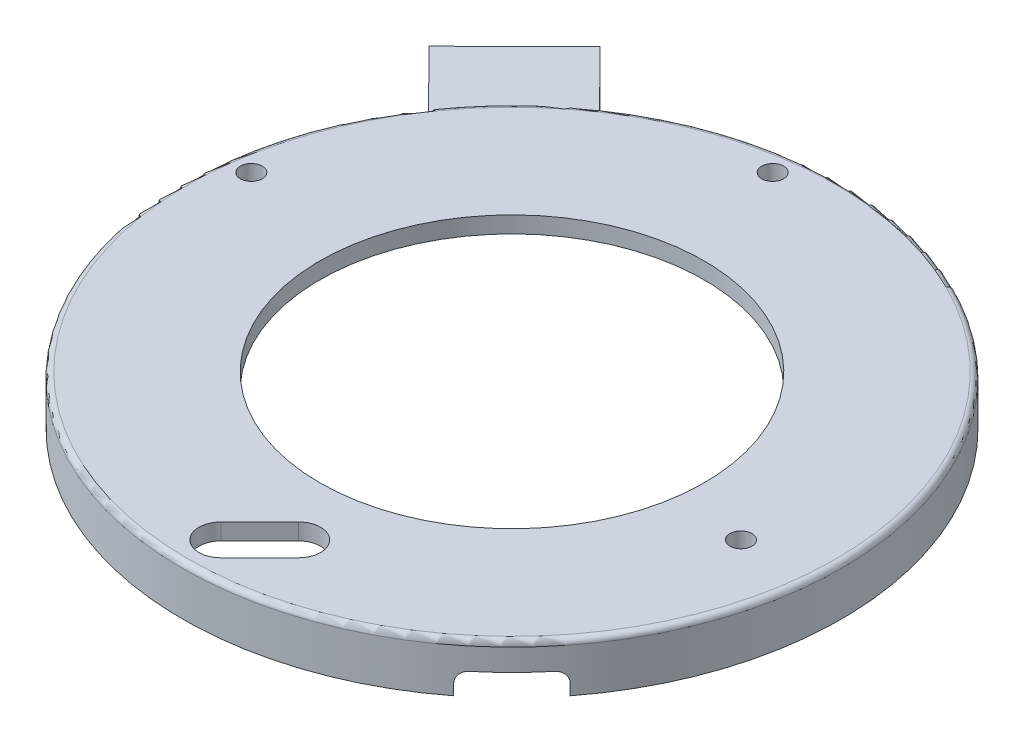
ISO-10303-21;
HEADER;
FILE_DESCRIPTION(('STEP AP214'),'2;1');
FILE_NAME('part.step','',(''),(''),'','','');
FILE_SCHEMA(('AUTOMOTIVE_DESIGN { 1 0 10303 214 1 1 1 1 }'));
ENDSEC;
DATA;
#1=APPLICATION_CONTEXT('core data for automotive mechanical design processes');
#2=APPLICATION_PROTOCOL_DEFINITION('international standard','automotive_design',2000,#1);
#3=PRODUCT_CONTEXT('',#1,'mechanical');
#4=PRODUCT('Part','Part','',(#3));
#5=PRODUCT_RELATED_PRODUCT_CATEGORY('part','',(#4));
#6=PRODUCT_DEFINITION_FORMATION('','',#4);
#7=PRODUCT_DEFINITION_CONTEXT('part definition',#1,'design');
#8=PRODUCT_DEFINITION('design','',#6,#7);
#9=PRODUCT_DEFINITION_SHAPE('','',#8);
#10=(LENGTH_UNIT() NAMED_UNIT(*) SI_UNIT(.MILLI.,.METRE.));
#11=(NAMED_UNIT(*) PLANE_ANGLE_UNIT() SI_UNIT($,.RADIAN.));
#12=(NAMED_UNIT(*) SI_UNIT($,.STERADIAN.) SOLID_ANGLE_UNIT());
#13=UNCERTAINTY_MEASURE_WITH_UNIT(LENGTH_MEASURE(1.E-05),#10,'distance_accuracy_value','');
#14=(GEOMETRIC_REPRESENTATION_CONTEXT(3) GLOBAL_UNCERTAINTY_ASSIGNED_CONTEXT((#13)) GLOBAL_UNIT_ASSIGNED_CONTEXT((#10,
#11,#12)) REPRESENTATION_CONTEXT('',''));
#15=CARTESIAN_POINT('',(0.,0.,0.));
#16=DIRECTION('',(0.,0.,1.));
#17=DIRECTION('',(1.,0.,0.));
#18=AXIS2_PLACEMENT_3D('',#15,#16,#17);
#19=CARTESIAN_POINT('',(0.,-6.,0.));
#20=DIRECTION('',(0.,1.,0.));
#21=DIRECTION('',(0.,0.,1.));
#22=AXIS2_PLACEMENT_3D('',#19,#20,#21);
#23=CYLINDRICAL_SURFACE('',#22,60.);
#24=CARTESIAN_POINT('',(0.,2.,0.));
#25=DIRECTION('',(0.,1.,0.));
#26=DIRECTION('',(0.,0.,1.));
#27=AXIS2_PLACEMENT_3D('',#24,#25,#26);
#28=CIRCLE('',#27,60.);
#29=CARTESIAN_POINT('',(-33.7004398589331,2.,-49.6415184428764));
#30=VERTEX_POINT('',#29);
#31=CARTESIAN_POINT('',(-49.3393981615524,2.,-34.1412329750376));
#32=VERTEX_POINT('',#31);
#33=EDGE_CURVE('E41',#30,#32,#28,.F.);
#34=ORIENTED_EDGE('',*,*,#33,.T.);
#35=DIRECTION('',(0.,1.,0.));
#36=VECTOR('',#35,1.);
#37=CARTESIAN_POINT('',(-49.3393981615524,-6.,-34.1412329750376));
#38=LINE('',#37,#36);
#39=CARTESIAN_POINT('',(-49.3393981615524,-6.,-34.1412329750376));
#40=VERTEX_POINT('',#39);
#41=EDGE_CURVE('E209',#40,#32,#38,.T.);
#42=ORIENTED_EDGE('',*,*,#41,.F.);
#43=CARTESIAN_POINT('',(0.,-6.,0.));
#44=DIRECTION('',(0.,1.,0.));
#45=DIRECTION('',(0.,0.,1.));
#46=AXIS2_PLACEMENT_3D('',#43,#44,#45);
#47=CIRCLE('',#46,60.);
#48=CARTESIAN_POINT('',(36.7903447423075,-6.,47.3969464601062));
#49=VERTEX_POINT('',#48);
#50=EDGE_CURVE('E372',#40,#49,#47,.T.);
#51=ORIENTED_EDGE('',*,*,#50,.T.);
#52=DIRECTION('',(0.,1.,0.));
#53=VECTOR('',#52,1.);
#54=CARTESIAN_POINT('',(36.7903447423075,-6.,47.3969464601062));
#55=LINE('',#54,#53);
#56=CARTESIAN_POINT('',(36.7903447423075,-4.00000000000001,47.3969464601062));
#57=VERTEX_POINT('',#56);
#58=EDGE_CURVE('E385',#49,#57,#55,.T.);
#59=ORIENTED_EDGE('',*,*,#58,.T.);
#60=CARTESIAN_POINT('',(36.7903447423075,-4.00000000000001,47.3969464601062));
#61=CARTESIAN_POINT('',(36.7903445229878,-3.94402619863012,47.3969460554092));
#62=CARTESIAN_POINT('',(36.7922168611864,-3.88807935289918,47.3954933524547));
#63=CARTESIAN_POINT('',(36.7996829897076,-3.77658900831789,47.389696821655));
#64=CARTESIAN_POINT('',(36.8052765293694,-3.72104548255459,47.3853531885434));
#65=CARTESIAN_POINT('',(36.827575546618,-3.55574238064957,47.3680277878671));
#66=CARTESIAN_POINT('',(36.8497996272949,-3.4470948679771,47.3507513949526));
#67=CARTESIAN_POINT('',(36.9082660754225,-3.2360782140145,47.3051926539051));
#68=CARTESIAN_POINT('',(36.9445138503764,-3.13371151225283,47.2769060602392));
#69=CARTESIAN_POINT('',(37.0298831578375,-2.93810429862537,47.2100696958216));
#70=CARTESIAN_POINT('',(37.0790034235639,-2.84486288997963,47.171520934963));
#71=CARTESIAN_POINT('',(37.1888212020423,-2.66974271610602,47.0849919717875));
#72=CARTESIAN_POINT('',(37.2495636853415,-2.58791029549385,47.0369751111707));
#73=CARTESIAN_POINT('',(37.3806741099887,-2.43827680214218,46.9328477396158));
#74=CARTESIAN_POINT('',(37.4510441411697,-2.37047878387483,46.8767354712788));
#75=CARTESIAN_POINT('',(37.5998344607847,-2.25036680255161,46.7574763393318));
#76=CARTESIAN_POINT('',(37.6783081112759,-2.19816561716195,46.6942825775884));
#77=CARTESIAN_POINT('',(37.8405738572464,-2.11136198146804,46.5628805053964));
#78=CARTESIAN_POINT('',(37.9243630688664,-2.07675007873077,46.4946749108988));
#79=CARTESIAN_POINT('',(38.0669809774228,-2.03433416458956,46.3779093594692));
#80=CARTESIAN_POINT('',(38.1250448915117,-2.02146960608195,46.3301911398));
#81=CARTESIAN_POINT('',(38.2416606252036,-2.00430303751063,46.2339827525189));
#82=CARTESIAN_POINT('',(38.3002116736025,-1.99998940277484,46.1854937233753));
#83=CARTESIAN_POINT('',(38.3586937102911,-2.00000000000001,46.1368683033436));
#84=B_SPLINE_CURVE_WITH_KNOTS('',3,(#60,#61,#62,#63,#64,#65,#66,#67,#68,#69,#70,#71,#72,#73,#74,
#75,#76,#77,#78,#79,#80,#81,#82,#83),.UNSPECIFIED.,.F.,.F.,(4,2,2,2,2,2,2,2,2,2,2,4),(0.,
0.167817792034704,0.335624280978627,0.67059928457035,1.00570358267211,1.34077491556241,
1.67716998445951,2.01363819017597,2.35248351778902,2.69114655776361,2.91943823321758,
3.14741934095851),.UNSPECIFIED.);
#85=CARTESIAN_POINT('',(38.3586937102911,-2.00000000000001,46.1368683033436));
#86=VERTEX_POINT('',#85);
#87=EDGE_CURVE('E274',#57,#86,#84,.T.);
#88=ORIENTED_EDGE('',*,*,#87,.T.);
#89=CARTESIAN_POINT('',(0.,-2.00000000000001,0.));
#90=DIRECTION('',(0.,1.,0.));
#91=DIRECTION('',(0.,0.,1.));
#92=AXIS2_PLACEMENT_3D('',#89,#90,#91);
#93=CIRCLE('',#92,60.);
#94=CARTESIAN_POINT('',(46.1368683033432,-2.00000000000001,38.3586937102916));
#95=VERTEX_POINT('',#94);
#96=EDGE_CURVE('E253',#86,#95,#93,.T.);
#97=ORIENTED_EDGE('',*,*,#96,.T.);
#98=CARTESIAN_POINT('',(46.1368683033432,-2.00000000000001,38.3586937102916));
#99=CARTESIAN_POINT('',(46.1731671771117,-2.00000048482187,38.3150350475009));
#100=CARTESIAN_POINT('',(46.2093857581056,-2.00239892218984,38.2713453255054));
#101=CARTESIAN_POINT('',(46.2814409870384,-2.01196421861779,38.1841774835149));
#102=CARTESIAN_POINT('',(46.3172776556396,-2.0191308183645,38.1406993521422));
#103=CARTESIAN_POINT('',(46.423775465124,-2.04771163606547,38.0111235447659));
#104=CARTESIAN_POINT('',(46.4935414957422,-2.07620707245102,37.9257435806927));
#105=CARTESIAN_POINT('',(46.6286210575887,-2.15128547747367,37.7595445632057));
#106=CARTESIAN_POINT('',(46.6939325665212,-2.19787659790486,37.6787275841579));
#107=CARTESIAN_POINT('',(46.8183420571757,-2.30783824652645,37.5240283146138));
#108=CARTESIAN_POINT('',(46.877441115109,-2.37120586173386,37.4501448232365));
#109=CARTESIAN_POINT('',(46.9878220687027,-2.51292344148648,37.3115590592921));
#110=CARTESIAN_POINT('',(47.0391074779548,-2.5912666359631,37.2468526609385));
#111=CARTESIAN_POINT('',(47.1325403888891,-2.76078188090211,37.1285514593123));
#112=CARTESIAN_POINT('',(47.1746862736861,-2.85195619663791,37.0749586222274));
#113=CARTESIAN_POINT('',(47.2485243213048,-3.04406959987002,36.9808129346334));
#114=CARTESIAN_POINT('',(47.2802650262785,-3.14496041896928,36.9401995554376));
#115=CARTESIAN_POINT('',(47.3327055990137,-3.3539833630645,36.8729821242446));
#116=CARTESIAN_POINT('',(47.3534130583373,-3.46211045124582,36.8463684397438));
#117=CARTESIAN_POINT('',(47.3778454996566,-3.64247319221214,36.8149425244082));
#118=CARTESIAN_POINT('',(47.385004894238,-3.71352479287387,36.8057252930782));
#119=CARTESIAN_POINT('',(47.3945541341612,-3.85637372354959,36.7934268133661));
#120=CARTESIAN_POINT('',(47.3969506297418,-3.92816987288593,36.7903370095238));
#121=CARTESIAN_POINT('',(47.3969464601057,-4.00000000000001,36.790344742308));
#122=B_SPLINE_CURVE_WITH_KNOTS('',3,(#98,#99,#100,#101,#102,#103,#104,#105,#106,#107,#108,#109,
#110,#111,#112,#113,#114,#115,#116,#117,#118,#119,#120,#121),.UNSPECIFIED.,.F.,.F.,(4,2,2,2,2,2,
2,2,2,2,2,4),(0.,0.170227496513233,0.340445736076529,0.680339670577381,1.02038689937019,
1.36037512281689,1.70021000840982,2.04010496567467,2.37839090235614,2.71644377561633,
2.93206295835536,3.14738086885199),.UNSPECIFIED.);
#123=CARTESIAN_POINT('',(47.3969464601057,-4.00000000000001,36.790344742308));
#124=VERTEX_POINT('',#123);
#125=EDGE_CURVE('E256',#95,#124,#122,.T.);
#126=ORIENTED_EDGE('',*,*,#125,.T.);
#127=DIRECTION('',(0.,1.,0.));
#128=VECTOR('',#127,1.);
#129=CARTESIAN_POINT('',(47.3969464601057,-6.,36.790344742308));
#130=LINE('',#129,#128);
#131=CARTESIAN_POINT('',(47.3969464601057,-6.,36.790344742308));
#132=VERTEX_POINT('',#131);
#133=EDGE_CURVE('E264',#124,#132,#130,.F.);
#134=ORIENTED_EDGE('',*,*,#133,.T.);
#135=CARTESIAN_POINT('',(-33.7004398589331,-6.,-49.6415184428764));
#136=VERTEX_POINT('',#135);
#137=EDGE_CURVE('E346',#132,#136,#47,.T.);
#138=ORIENTED_EDGE('',*,*,#137,.T.);
#139=DIRECTION('',(0.,1.,0.));
#140=VECTOR('',#139,1.);
#141=CARTESIAN_POINT('',(-33.7004398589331,-6.,-49.6415184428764));
#142=LINE('',#141,#140);
#143=EDGE_CURVE('E202',#136,#30,#142,.T.);
#144=ORIENTED_EDGE('',*,*,#143,.T.);
#145=EDGE_LOOP('',(#34,#42,#51,#59,#88,#97,#126,#134,#138,#144));
#146=FACE_BOUND('',#145,.T.);
#147=ADVANCED_FACE('F33',(#146),#23,.T.);
#148=CARTESIAN_POINT('',(0.,0.,0.));
#149=DIRECTION('',(0.,1.,0.));
#150=DIRECTION('',(0.,0.,1.));
#151=AXIS2_PLACEMENT_3D('',#148,#149,#150);
#152=PLANE('',#151);
#153=CARTESIAN_POINT('',(0.,0.,0.));
#154=DIRECTION('',(0.,1.,0.));
#155=DIRECTION('',(0.,0.,1.));
#156=AXIS2_PLACEMENT_3D('',#153,#154,#155);
#157=CIRCLE('',#156,35.);
#158=CARTESIAN_POINT('',(0.,0.,35.));
#159=VERTEX_POINT('',#158);
#160=EDGE_CURVE('E166',#159,#159,#157,.T.);
#161=ORIENTED_EDGE('',*,*,#160,.T.);
#162=EDGE_LOOP('',(#161));
#163=FACE_BOUND('',#162,.T.);
#164=CARTESIAN_POINT('',(47.3431457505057,0.,5.65685424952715));
#165=DIRECTION('',(0.,1.,0.));
#166=DIRECTION('',(0.,0.,1.));
#167=AXIS2_PLACEMENT_3D('',#164,#165,#166);
#168=CIRCLE('',#167,2.);
#169=CARTESIAN_POINT('',(47.3431457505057,0.,7.65685424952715));
#170=VERTEX_POINT('',#169);
#171=EDGE_CURVE('E183',#170,#170,#168,.T.);
#172=ORIENTED_EDGE('',*,*,#171,.T.);
#173=EDGE_LOOP('',(#172));
#174=FACE_BOUND('',#173,.T.);
#175=CARTESIAN_POINT('',(-55.1702534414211,0.,-7.69999999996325));
#176=DIRECTION('',(0.,1.,0.));
#177=DIRECTION('',(0.,0.,1.));
#178=AXIS2_PLACEMENT_3D('',#175,#176,#177);
#179=CIRCLE('',#178,2.);
#180=CARTESIAN_POINT('',(-55.1702534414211,0.,-5.69999999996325));
#181=VERTEX_POINT('',#180);
#182=EDGE_CURVE('E180',#181,#181,#179,.T.);
#183=ORIENTED_EDGE('',*,*,#182,.T.);
#184=EDGE_LOOP('',(#183));
#185=FACE_BOUND('',#184,.T.);
#186=DIRECTION('',(-0.707106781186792,0.,0.707106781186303));
#187=VECTOR('',#186,1.);
#188=CARTESIAN_POINT('',(23.6715728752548,0.,23.6715728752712));
#189=LINE('',#188,#187);
#190=CARTESIAN_POINT('',(4.24264068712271,0.,43.1005050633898));
#191=VERTEX_POINT('',#190);
#192=CARTESIAN_POINT('',(-2.82842712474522,0.,50.1715728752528));
#193=VERTEX_POINT('',#192);
#194=EDGE_CURVE('E174',#191,#193,#189,.T.);
#195=ORIENTED_EDGE('',*,*,#194,.T.);
#196=CARTESIAN_POINT('',(0.,0.,53.));
#197=DIRECTION('',(0.,1.,0.));
#198=DIRECTION('',(0.,0.,1.));
#199=AXIS2_PLACEMENT_3D('',#196,#197,#198);
#200=CIRCLE('',#199,4.);
#201=CARTESIAN_POINT('',(2.82842712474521,0.,55.8284271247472));
#202=VERTEX_POINT('',#201);
#203=EDGE_CURVE('E177',#193,#202,#200,.T.);
#204=ORIENTED_EDGE('',*,*,#203,.T.);
#205=DIRECTION('',(0.707106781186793,0.,-0.707106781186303));
#206=VECTOR('',#205,1.);
#207=CARTESIAN_POINT('',(29.3284271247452,0.,29.3284271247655));
#208=LINE('',#207,#206);
#209=CARTESIAN_POINT('',(9.89949493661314,0.,48.7573593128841));
#210=VERTEX_POINT('',#209);
#211=EDGE_CURVE('E170',#202,#210,#208,.T.);
#212=ORIENTED_EDGE('',*,*,#211,.T.);
#213=CARTESIAN_POINT('',(7.07106781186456,0.,45.9289321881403));
#214=DIRECTION('',(0.,1.,0.));
#215=DIRECTION('',(0.,0.,1.));
#216=AXIS2_PLACEMENT_3D('',#213,#214,#215);
#217=CIRCLE('',#216,4.);
#218=EDGE_CURVE('E140',#210,#191,#217,.T.);
#219=ORIENTED_EDGE('',*,*,#218,.T.);
#220=EDGE_LOOP('',(#195,#204,#212,#219));
#221=FACE_BOUND('',#220,.T.);
#222=CARTESIAN_POINT('',(-7.7,0.,-55.1702534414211));
#223=DIRECTION('',(0.,1.,0.));
#224=DIRECTION('',(0.,0.,1.));
#225=AXIS2_PLACEMENT_3D('',#222,#223,#224);
#226=CIRCLE('',#225,2.);
#227=CARTESIAN_POINT('',(-7.7,0.,-53.1702534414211));
#228=VERTEX_POINT('',#227);
#229=EDGE_CURVE('E167',#228,#228,#226,.T.);
#230=ORIENTED_EDGE('',*,*,#229,.T.);
#231=EDGE_LOOP('',(#230));
#232=FACE_BOUND('',#231,.T.);
#233=CARTESIAN_POINT('',(28.2842712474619,0.,28.2842712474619));
#234=DIRECTION('',(0.,1.,0.));
#235=DIRECTION('',(0.,0.,1.));
#236=AXIS2_PLACEMENT_3D('',#233,#234,#235);
#237=CIRCLE('',#236,2.5);
#238=CARTESIAN_POINT('',(28.2842712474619,0.,30.7842712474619));
#239=VERTEX_POINT('',#238);
#240=EDGE_CURVE('E220',#239,#239,#237,.F.);
#241=ORIENTED_EDGE('',*,*,#240,.F.);
#242=EDGE_LOOP('',(#241));
#243=FACE_BOUND('',#242,.T.);
#244=CARTESIAN_POINT('',(0.,0.,0.));
#245=DIRECTION('',(0.,1.,0.));
#246=DIRECTION('',(0.,0.,1.));
#247=AXIS2_PLACEMENT_3D('',#244,#245,#246);
#248=CIRCLE('',#247,58.);
#249=CARTESIAN_POINT('',(0.,0.,58.));
#250=VERTEX_POINT('',#249);
#251=EDGE_CURVE('E340',#250,#250,#248,.T.);
#252=ORIENTED_EDGE('',*,*,#251,.F.);
#253=EDGE_LOOP('',(#252));
#254=FACE_BOUND('',#253,.T.);
#255=ADVANCED_FACE('F309',(#163,#174,#185,#221,#232,#243,#254),#152,.F.);
#256=CARTESIAN_POINT('',(28.2842712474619,-3.,28.2842712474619));
#257=DIRECTION('',(0.,1.,0.));
#258=DIRECTION('',(0.,0.,1.));
#259=AXIS2_PLACEMENT_3D('',#256,#257,#258);
#260=CYLINDRICAL_SURFACE('',#259,2.5);
#261=CARTESIAN_POINT('',(28.2842712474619,-3.,28.2842712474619));
#262=DIRECTION('',(0.,-1.,0.));
#263=DIRECTION('',(0.,0.,-1.));
#264=AXIS2_PLACEMENT_3D('',#261,#262,#263);
#265=CIRCLE('',#264,2.5);
#266=CARTESIAN_POINT('',(28.2842712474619,-3.,25.7842712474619));
#267=VERTEX_POINT('',#266);
#268=EDGE_CURVE('E342',#267,#267,#265,.T.);
#269=ORIENTED_EDGE('',*,*,#268,.F.);
#270=EDGE_LOOP('',(#269));
#271=FACE_BOUND('',#270,.T.);
#272=ORIENTED_EDGE('',*,*,#240,.T.);
#273=EDGE_LOOP('',(#272));
#274=FACE_BOUND('',#273,.T.);
#275=ADVANCED_FACE('F313',(#271,#274),#260,.T.);
#276=CARTESIAN_POINT('',(28.2842712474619,-3.,28.2842712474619));
#277=DIRECTION('',(0.,-1.,0.));
#278=DIRECTION('',(0.,0.,-1.));
#279=AXIS2_PLACEMENT_3D('',#276,#277,#278);
#280=PLANE('',#279);
#281=CARTESIAN_POINT('',(28.2842712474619,-3.,28.2842712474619));
#282=DIRECTION('',(0.,-1.,0.));
#283=DIRECTION('',(0.,0.,-1.));
#284=AXIS2_PLACEMENT_3D('',#281,#282,#283);
#285=CIRCLE('',#284,2.);
#286=CARTESIAN_POINT('',(28.2842712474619,-3.,26.2842712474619));
#287=VERTEX_POINT('',#286);
#288=EDGE_CURVE('E216',#287,#287,#285,.T.);
#289=ORIENTED_EDGE('',*,*,#288,.F.);
#290=EDGE_LOOP('',(#289));
#291=FACE_BOUND('',#290,.T.);
#292=ORIENTED_EDGE('',*,*,#268,.T.);
#293=EDGE_LOOP('',(#292));
#294=FACE_BOUND('',#293,.T.);
#295=ADVANCED_FACE('F302',(#291,#294),#280,.T.);
#296=CARTESIAN_POINT('',(0.,-6.,0.));
#297=DIRECTION('',(0.,1.,0.));
#298=DIRECTION('',(0.,0.,1.));
#299=AXIS2_PLACEMENT_3D('',#296,#297,#298);
#300=CYLINDRICAL_SURFACE('',#299,58.);
#301=CARTESIAN_POINT('',(0.,-6.,0.));
#302=DIRECTION('',(0.,1.,0.));
#303=DIRECTION('',(0.,0.,1.));
#304=AXIS2_PLACEMENT_3D('',#301,#302,#303);
#305=CIRCLE('',#304,58.);
#306=CARTESIAN_POINT('',(45.9711628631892,-6.,35.3645611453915));
#307=VERTEX_POINT('',#306);
#308=CARTESIAN_POINT('',(35.364561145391,-6.,45.9711628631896));
#309=VERTEX_POINT('',#308);
#310=EDGE_CURVE('E283',#307,#309,#305,.T.);
#311=ORIENTED_EDGE('',*,*,#310,.F.);
#312=DIRECTION('',(0.,1.,0.));
#313=VECTOR('',#312,1.);
#314=CARTESIAN_POINT('',(45.9711628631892,-6.,35.3645611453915));
#315=LINE('',#314,#313);
#316=CARTESIAN_POINT('',(45.9711628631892,-4.00000000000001,35.3645611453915));
#317=VERTEX_POINT('',#316);
#318=EDGE_CURVE('E248',#307,#317,#315,.T.);
#319=ORIENTED_EDGE('',*,*,#318,.T.);
#320=CARTESIAN_POINT('',(45.9711628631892,-4.00000000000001,35.3645611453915));
#321=CARTESIAN_POINT('',(45.9711624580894,-3.9440470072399,35.3645609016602));
#322=CARTESIAN_POINT('',(45.969718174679,-3.88812097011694,35.3664392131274));
#323=CARTESIAN_POINT('',(45.9639552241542,-3.77667230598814,35.3739290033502));
#324=CARTESIAN_POINT('',(45.9596367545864,-3.7211496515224,35.3795402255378));
#325=CARTESIAN_POINT('',(45.9424118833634,-3.55591098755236,35.4019090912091));
#326=CARTESIAN_POINT('',(45.9252358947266,-3.44730695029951,35.424202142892));
#327=CARTESIAN_POINT('',(45.8799414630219,-3.23637599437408,35.482845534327));
#328=CARTESIAN_POINT('',(45.8518188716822,-3.13405147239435,35.519201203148));
#329=CARTESIAN_POINT('',(45.7853678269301,-2.93852203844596,35.6048173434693));
#330=CARTESIAN_POINT('',(45.7470403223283,-2.84531627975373,35.6540766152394));
#331=CARTESIAN_POINT('',(45.6609912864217,-2.67023126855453,35.7642106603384));
#332=CARTESIAN_POINT('',(45.6132307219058,-2.58840157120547,35.8251336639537));
#333=CARTESIAN_POINT('',(45.5096486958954,-2.43876286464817,35.956624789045));
#334=CARTESIAN_POINT('',(45.4538254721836,-2.37095692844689,36.0271950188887));
#335=CARTESIAN_POINT('',(45.3351372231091,-2.25078439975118,36.1764354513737));
#336=CARTESIAN_POINT('',(45.2722222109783,-2.19853824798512,36.2551627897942));
#337=CARTESIAN_POINT('',(45.1413786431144,-2.11164325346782,36.4179462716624));
#338=CARTESIAN_POINT('',(45.0734527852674,-2.07698501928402,36.5019995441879));
#339=CARTESIAN_POINT('',(44.9570626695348,-2.03446044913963,36.6451641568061));
#340=CARTESIAN_POINT('',(44.9094407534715,-2.02154878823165,36.7035122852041));
#341=CARTESIAN_POINT('',(44.8134147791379,-2.00431903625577,36.8206959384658));
#342=CARTESIAN_POINT('',(44.7650118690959,-1.99998931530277,36.8795306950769));
#343=CARTESIAN_POINT('',(44.7164678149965,-2.00000000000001,36.938293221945));
#344=B_SPLINE_CURVE_WITH_KNOTS('',3,(#320,#321,#322,#323,#324,#325,#326,#327,#328,#329,#330,
#331,#332,#333,#334,#335,#336,#337,#338,#339,#340,#341,#342,#343),.UNSPECIFIED.,.F.,.F.,(4,2,2,
2,2,2,2,2,2,2,2,4),(0.,0.167755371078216,0.335499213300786,0.670343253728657,1.0053143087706,
1.34025423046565,1.67661029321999,2.01303998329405,2.35200989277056,2.69079861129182,
2.91958134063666,3.14805382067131),.UNSPECIFIED.);
#345=CARTESIAN_POINT('',(44.7164678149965,-2.00000000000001,36.9382932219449));
#346=VERTEX_POINT('',#345);
#347=EDGE_CURVE('E239',#317,#346,#344,.T.);
#348=ORIENTED_EDGE('',*,*,#347,.T.);
#349=CARTESIAN_POINT('',(0.,-2.00000000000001,0.));
#350=DIRECTION('',(0.,-1.,0.));
#351=DIRECTION('',(0.,0.,-1.));
#352=AXIS2_PLACEMENT_3D('',#349,#350,#351);
#353=CIRCLE('',#352,58.);
#354=CARTESIAN_POINT('',(36.9382932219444,-2.00000000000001,44.7164678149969));
#355=VERTEX_POINT('',#354);
#356=EDGE_CURVE('E247',#346,#355,#353,.T.);
#357=ORIENTED_EDGE('',*,*,#356,.T.);
#358=CARTESIAN_POINT('',(36.9382932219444,-2.00000000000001,44.7164678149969));
#359=CARTESIAN_POINT('',(36.8944917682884,-2.00000049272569,44.7526508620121));
#360=CARTESIAN_POINT('',(36.8506576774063,-2.00240053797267,44.7887512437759));
#361=CARTESIAN_POINT('',(36.7631989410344,-2.01197202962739,44.8605661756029));
#362=CARTESIAN_POINT('',(36.7195742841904,-2.01914321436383,44.8962807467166));
#363=CARTESIAN_POINT('',(36.5895572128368,-2.04774198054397,45.0024083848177));
#364=CARTESIAN_POINT('',(36.5038807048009,-2.07625497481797,45.0719218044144));
#365=CARTESIAN_POINT('',(36.337094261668,-2.1513787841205,45.2064940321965));
#366=CARTESIAN_POINT('',(36.2559863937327,-2.19799771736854,45.2715508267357));
#367=CARTESIAN_POINT('',(36.1007217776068,-2.30802586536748,45.3954596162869));
#368=CARTESIAN_POINT('',(36.0265638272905,-2.37143216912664,45.4543126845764));
#369=CARTESIAN_POINT('',(35.8874603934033,-2.51323699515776,45.5642190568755));
#370=CARTESIAN_POINT('',(35.8225104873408,-2.59162827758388,45.615276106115));
#371=CARTESIAN_POINT('',(35.7037642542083,-2.76125172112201,45.7082806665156));
#372=CARTESIAN_POINT('',(35.6499698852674,-2.85248613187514,45.7502265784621));
#373=CARTESIAN_POINT('',(35.5554944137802,-3.04469642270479,45.8236881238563));
#374=CARTESIAN_POINT('',(35.5147480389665,-3.14562042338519,45.8552556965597));
#375=CARTESIAN_POINT('',(35.4473221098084,-3.35471182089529,45.9073979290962));
#376=CARTESIAN_POINT('',(35.4206327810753,-3.4628741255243,45.9279802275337));
#377=CARTESIAN_POINT('',(35.3891621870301,-3.64314301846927,45.9522299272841));
#378=CARTESIAN_POINT('',(35.3799437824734,-3.71406278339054,45.9593263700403));
#379=CARTESIAN_POINT('',(35.3676436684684,-3.85664447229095,45.9687915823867));
#380=CARTESIAN_POINT('',(35.3645534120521,-3.9283052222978,45.9711669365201));
#381=CARTESIAN_POINT('',(35.364561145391,-4.00000000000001,45.9711628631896));
#382=B_SPLINE_CURVE_WITH_KNOTS('',3,(#358,#359,#360,#361,#362,#363,#364,#365,#366,#367,#368,
#369,#370,#371,#372,#373,#374,#375,#376,#377,#378,#379,#380,#381),.UNSPECIFIED.,.F.,.F.,(4,2,2,
2,2,2,2,2,2,2,2,4),(0.,0.17033550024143,0.340661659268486,0.68077240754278,1.02103582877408,
1.36124028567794,1.70128078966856,2.04138093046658,2.37975214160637,2.71788775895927,
2.9331003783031,3.14801262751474),.UNSPECIFIED.);
#383=CARTESIAN_POINT('',(35.364561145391,-4.00000000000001,45.9711628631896));
#384=VERTEX_POINT('',#383);
#385=EDGE_CURVE('E215',#355,#384,#382,.T.);
#386=ORIENTED_EDGE('',*,*,#385,.T.);
#387=DIRECTION('',(0.,1.,0.));
#388=VECTOR('',#387,1.);
#389=CARTESIAN_POINT('',(35.364561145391,-6.,45.9711628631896));
#390=LINE('',#389,#388);
#391=EDGE_CURVE('E229',#384,#309,#390,.F.);
#392=ORIENTED_EDGE('',*,*,#391,.T.);
#393=EDGE_LOOP('',(#311,#319,#348,#357,#386,#392));
#394=FACE_BOUND('',#393,.T.);
#395=ORIENTED_EDGE('',*,*,#251,.T.);
#396=EDGE_LOOP('',(#395));
#397=FACE_BOUND('',#396,.T.);
#398=ADVANCED_FACE('F298',(#394,#397),#300,.F.);
#399=CARTESIAN_POINT('',(0.,-6.,0.));
#400=DIRECTION('',(0.,1.,0.));
#401=DIRECTION('',(0.,0.,1.));
#402=AXIS2_PLACEMENT_3D('',#399,#400,#401);
#403=PLANE('',#402);
#404=ORIENTED_EDGE('',*,*,#50,.F.);
#405=DIRECTION('',(-0.704092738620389,0.,-0.710108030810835));
#406=VECTOR('',#405,1.);
#407=CARTESIAN_POINT('',(-49.3393981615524,-6.,-34.1412329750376));
#408=LINE('',#407,#406);
#409=CARTESIAN_POINT('',(-59.9007892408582,-6.,-44.7928534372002));
#410=VERTEX_POINT('',#409);
#411=EDGE_CURVE('E195',#40,#410,#408,.T.);
#412=ORIENTED_EDGE('',*,*,#411,.T.);
#413=DIRECTION('',(0.710248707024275,0.,-0.703950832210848));
#414=VECTOR('',#413,1.);
#415=CARTESIAN_POINT('',(-59.9007892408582,-6.,-44.7928534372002));
#416=LINE('',#415,#414);
#417=CARTESIAN_POINT('',(-44.2597021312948,-6.,-60.2952488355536));
#418=VERTEX_POINT('',#417);
#419=EDGE_CURVE('E197',#410,#418,#416,.T.);
#420=ORIENTED_EDGE('',*,*,#419,.T.);
#421=DIRECTION('',(0.703950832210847,0.,0.710248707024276));
#422=VECTOR('',#421,1.);
#423=CARTESIAN_POINT('',(-44.2597021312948,-6.,-60.2952488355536));
#424=LINE('',#423,#422);
#425=EDGE_CURVE('E199',#418,#136,#424,.T.);
#426=ORIENTED_EDGE('',*,*,#425,.T.);
#427=ORIENTED_EDGE('',*,*,#137,.F.);
#428=DIRECTION('',(0.707106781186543,0.,0.707106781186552));
#429=VECTOR('',#428,1.);
#430=CARTESIAN_POINT('',(65.3043008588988,-6.,54.6976991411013));
#431=LINE('',#430,#429);
#432=EDGE_CURVE('E249',#307,#132,#431,.T.);
#433=ORIENTED_EDGE('',*,*,#432,.F.);
#434=ORIENTED_EDGE('',*,*,#310,.T.);
#435=DIRECTION('',(-0.707106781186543,0.,-0.707106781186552));
#436=VECTOR('',#435,1.);
#437=CARTESIAN_POINT('',(54.6976991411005,-6.,65.3043008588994));
#438=LINE('',#437,#436);
#439=EDGE_CURVE('E251',#49,#309,#438,.T.);
#440=ORIENTED_EDGE('',*,*,#439,.F.);
#441=EDGE_LOOP('',(#404,#412,#420,#426,#427,#433,#434,#440));
#442=FACE_BOUND('',#441,.T.);
#443=ADVANCED_FACE('F301',(#442),#403,.F.);
#444=CARTESIAN_POINT('',(56.1119127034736,-2.00000000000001,63.8900872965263));
#445=DIRECTION('',(0.,1.,0.));
#446=DIRECTION('',(0.,0.,1.));
#447=AXIS2_PLACEMENT_3D('',#444,#445,#446);
#448=PLANE('',#447);
#449=DIRECTION('',(-0.707106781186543,0.,-0.707106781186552));
#450=VECTOR('',#449,1.);
#451=CARTESIAN_POINT('',(56.1119127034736,-2.00000000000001,63.8900872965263));
#452=LINE('',#451,#450);
#453=EDGE_CURVE('E384',#86,#355,#452,.T.);
#454=ORIENTED_EDGE('',*,*,#453,.T.);
#455=ORIENTED_EDGE('',*,*,#356,.F.);
#456=DIRECTION('',(-0.707106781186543,0.,-0.707106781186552));
#457=VECTOR('',#456,1.);
#458=CARTESIAN_POINT('',(63.8900872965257,-2.00000000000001,56.1119127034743));
#459=LINE('',#458,#457);
#460=EDGE_CURVE('E386',#95,#346,#459,.T.);
#461=ORIENTED_EDGE('',*,*,#460,.F.);
#462=ORIENTED_EDGE('',*,*,#96,.F.);
#463=EDGE_LOOP('',(#454,#455,#461,#462));
#464=FACE_BOUND('',#463,.T.);
#465=ADVANCED_FACE('F293',(#464),#448,.F.);
#466=CARTESIAN_POINT('',(54.6976991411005,-10.,65.3043008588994));
#467=DIRECTION('',(-0.707106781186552,0.,0.707106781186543));
#468=DIRECTION('',(0.707106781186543,0.,0.707106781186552));
#469=AXIS2_PLACEMENT_3D('',#466,#467,#468);
#470=PLANE('',#469);
#471=ORIENTED_EDGE('',*,*,#439,.T.);
#472=ORIENTED_EDGE('',*,*,#391,.F.);
#473=DIRECTION('',(-0.707106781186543,0.,-0.707106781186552));
#474=VECTOR('',#473,1.);
#475=CARTESIAN_POINT('',(54.6976991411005,-4.00000000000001,65.3043008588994));
#476=LINE('',#475,#474);
#477=EDGE_CURVE('E285',#57,#384,#476,.T.);
#478=ORIENTED_EDGE('',*,*,#477,.F.);
#479=ORIENTED_EDGE('',*,*,#58,.F.);
#480=EDGE_LOOP('',(#471,#472,#478,#479));
#481=FACE_BOUND('',#480,.T.);
#482=ADVANCED_FACE('F294',(#481),#470,.F.);
#483=CARTESIAN_POINT('',(65.3043008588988,-10.,54.6976991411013));
#484=DIRECTION('',(0.707106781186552,0.,-0.707106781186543));
#485=DIRECTION('',(-0.707106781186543,0.,-0.707106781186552));
#486=AXIS2_PLACEMENT_3D('',#483,#484,#485);
#487=PLANE('',#486);
#488=DIRECTION('',(-0.707106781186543,0.,-0.707106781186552));
#489=VECTOR('',#488,1.);
#490=CARTESIAN_POINT('',(65.3043008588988,-4.00000000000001,54.6976991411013));
#491=LINE('',#490,#489);
#492=EDGE_CURVE('E284',#124,#317,#491,.T.);
#493=ORIENTED_EDGE('',*,*,#492,.T.);
#494=ORIENTED_EDGE('',*,*,#318,.F.);
#495=ORIENTED_EDGE('',*,*,#432,.T.);
#496=ORIENTED_EDGE('',*,*,#133,.F.);
#497=EDGE_LOOP('',(#493,#494,#495,#496));
#498=FACE_BOUND('',#497,.T.);
#499=ADVANCED_FACE('F271',(#498),#487,.F.);
#500=CARTESIAN_POINT('',(63.8900872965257,-4.00000000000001,56.1119127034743));
#501=DIRECTION('',(-0.707106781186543,0.,-0.707106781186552));
#502=DIRECTION('',(-0.707106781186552,0.,0.707106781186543));
#503=AXIS2_PLACEMENT_3D('',#500,#501,#502);
#504=CYLINDRICAL_SURFACE('',#503,2.);
#505=ORIENTED_EDGE('',*,*,#460,.T.);
#506=ORIENTED_EDGE('',*,*,#347,.F.);
#507=ORIENTED_EDGE('',*,*,#492,.F.);
#508=ORIENTED_EDGE('',*,*,#125,.F.);
#509=EDGE_LOOP('',(#505,#506,#507,#508));
#510=FACE_BOUND('',#509,.T.);
#511=ADVANCED_FACE('F266',(#510),#504,.F.);
#512=CARTESIAN_POINT('',(56.1119127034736,-4.00000000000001,63.8900872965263));
#513=DIRECTION('',(-0.707106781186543,0.,-0.707106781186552));
#514=DIRECTION('',(-0.707106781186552,0.,0.707106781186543));
#515=AXIS2_PLACEMENT_3D('',#512,#513,#514);
#516=CYLINDRICAL_SURFACE('',#515,2.);
#517=ORIENTED_EDGE('',*,*,#477,.T.);
#518=ORIENTED_EDGE('',*,*,#385,.F.);
#519=ORIENTED_EDGE('',*,*,#453,.F.);
#520=ORIENTED_EDGE('',*,*,#87,.F.);
#521=EDGE_LOOP('',(#517,#518,#519,#520));
#522=FACE_BOUND('',#521,.T.);
#523=ADVANCED_FACE('F288',(#522),#516,.F.);
#524=CARTESIAN_POINT('',(0.,3.,0.));
#525=DIRECTION('',(0.,1.,0.));
#526=DIRECTION('',(0.,0.,1.));
#527=AXIS2_PLACEMENT_3D('',#524,#525,#526);
#528=PLANE('',#527);
#529=CARTESIAN_POINT('',(0.,3.,0.));
#530=DIRECTION('',(0.,1.,0.));
#531=DIRECTION('',(0.,0.,1.));
#532=AXIS2_PLACEMENT_3D('',#529,#530,#531);
#533=CIRCLE('',#532,35.);
#534=CARTESIAN_POINT('',(0.,3.,35.));
#535=VERTEX_POINT('',#534);
#536=EDGE_CURVE('E614',#535,#535,#533,.T.);
#537=ORIENTED_EDGE('',*,*,#536,.F.);
#538=EDGE_LOOP('',(#537));
#539=FACE_BOUND('',#538,.T.);
#540=CARTESIAN_POINT('',(47.3431457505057,3.,5.65685424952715));
#541=DIRECTION('',(0.,1.,0.));
#542=DIRECTION('',(0.,0.,1.));
#543=AXIS2_PLACEMENT_3D('',#540,#541,#542);
#544=CIRCLE('',#543,2.);
#545=CARTESIAN_POINT('',(47.3431457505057,3.,7.65685424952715));
#546=VERTEX_POINT('',#545);
#547=EDGE_CURVE('E171',#546,#546,#544,.T.);
#548=ORIENTED_EDGE('',*,*,#547,.F.);
#549=EDGE_LOOP('',(#548));
#550=FACE_BOUND('',#549,.T.);
#551=CARTESIAN_POINT('',(-55.1702534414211,3.,-7.69999999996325));
#552=DIRECTION('',(0.,1.,0.));
#553=DIRECTION('',(0.,0.,1.));
#554=AXIS2_PLACEMENT_3D('',#551,#552,#553);
#555=CIRCLE('',#554,2.);
#556=CARTESIAN_POINT('',(-55.1702534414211,3.,-5.69999999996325));
#557=VERTEX_POINT('',#556);
#558=EDGE_CURVE('E160',#557,#557,#555,.T.);
#559=ORIENTED_EDGE('',*,*,#558,.F.);
#560=EDGE_LOOP('',(#559));
#561=FACE_BOUND('',#560,.T.);
#562=CARTESIAN_POINT('',(0.,3.,53.));
#563=DIRECTION('',(0.,1.,0.));
#564=DIRECTION('',(0.,0.,1.));
#565=AXIS2_PLACEMENT_3D('',#562,#563,#564);
#566=CIRCLE('',#565,4.);
#567=CARTESIAN_POINT('',(-2.82842712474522,3.,50.1715728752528));
#568=VERTEX_POINT('',#567);
#569=CARTESIAN_POINT('',(2.82842712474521,3.,55.8284271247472));
#570=VERTEX_POINT('',#569);
#571=EDGE_CURVE('E56',#568,#570,#566,.T.);
#572=ORIENTED_EDGE('',*,*,#571,.F.);
#573=DIRECTION('',(-0.707106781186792,0.,0.707106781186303));
#574=VECTOR('',#573,1.);
#575=CARTESIAN_POINT('',(-2.82842712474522,3.,50.1715728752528));
#576=LINE('',#575,#574);
#577=CARTESIAN_POINT('',(4.24264068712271,3.,43.1005050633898));
#578=VERTEX_POINT('',#577);
#579=EDGE_CURVE('E153',#578,#568,#576,.T.);
#580=ORIENTED_EDGE('',*,*,#579,.F.);
#581=CARTESIAN_POINT('',(7.07106781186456,3.,45.9289321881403));
#582=DIRECTION('',(0.,1.,0.));
#583=DIRECTION('',(0.,0.,1.));
#584=AXIS2_PLACEMENT_3D('',#581,#582,#583);
#585=CIRCLE('',#584,4.);
#586=CARTESIAN_POINT('',(9.89949493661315,3.,48.7573593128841));
#587=VERTEX_POINT('',#586);
#588=EDGE_CURVE('E137',#587,#578,#585,.T.);
#589=ORIENTED_EDGE('',*,*,#588,.F.);
#590=DIRECTION('',(0.707106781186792,0.,-0.707106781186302));
#591=VECTOR('',#590,1.);
#592=CARTESIAN_POINT('',(2.82842712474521,3.,55.8284271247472));
#593=LINE('',#592,#591);
#594=EDGE_CURVE('E146',#570,#587,#593,.T.);
#595=ORIENTED_EDGE('',*,*,#594,.F.);
#596=EDGE_LOOP('',(#572,#580,#589,#595));
#597=FACE_BOUND('',#596,.T.);
#598=CARTESIAN_POINT('',(-7.7,3.,-55.1702534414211));
#599=DIRECTION('',(0.,1.,0.));
#600=DIRECTION('',(0.,0.,1.));
#601=AXIS2_PLACEMENT_3D('',#598,#599,#600);
#602=CIRCLE('',#601,2.);
#603=CARTESIAN_POINT('',(-7.7,3.,-53.1702534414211));
#604=VERTEX_POINT('',#603);
#605=EDGE_CURVE('E163',#604,#604,#602,.T.);
#606=ORIENTED_EDGE('',*,*,#605,.F.);
#607=EDGE_LOOP('',(#606));
#608=FACE_BOUND('',#607,.T.);
#609=CARTESIAN_POINT('',(0.,3.,0.));
#610=DIRECTION('',(0.,1.,0.));
#611=DIRECTION('',(0.,0.,1.));
#612=AXIS2_PLACEMENT_3D('',#609,#610,#611);
#613=CIRCLE('',#612,59.);
#614=CARTESIAN_POINT('',(0.,3.,59.));
#615=VERTEX_POINT('',#614);
#616=EDGE_CURVE('E219',#615,#615,#613,.T.);
#617=ORIENTED_EDGE('',*,*,#616,.T.);
#618=EDGE_LOOP('',(#617));
#619=FACE_BOUND('',#618,.T.);
#620=ADVANCED_FACE('F150',(#539,#550,#561,#597,#608,#619),#528,.T.);
#621=CARTESIAN_POINT('',(28.2842712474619,-7.,28.2842712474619));
#622=DIRECTION('',(0.,1.,0.));
#623=DIRECTION('',(0.,0.,1.));
#624=AXIS2_PLACEMENT_3D('',#621,#622,#623);
#625=CYLINDRICAL_SURFACE('',#624,2.);
#626=CARTESIAN_POINT('',(28.2842712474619,-7.,28.2842712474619));
#627=DIRECTION('',(0.,-1.,0.));
#628=DIRECTION('',(0.,0.,-1.));
#629=AXIS2_PLACEMENT_3D('',#626,#627,#628);
#630=CIRCLE('',#629,2.);
#631=CARTESIAN_POINT('',(28.2842712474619,-7.,26.2842712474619));
#632=VERTEX_POINT('',#631);
#633=EDGE_CURVE('E212',#632,#632,#630,.T.);
#634=ORIENTED_EDGE('',*,*,#633,.F.);
#635=EDGE_LOOP('',(#634));
#636=FACE_BOUND('',#635,.T.);
#637=ORIENTED_EDGE('',*,*,#288,.T.);
#638=EDGE_LOOP('',(#637));
#639=FACE_BOUND('',#638,.T.);
#640=ADVANCED_FACE('F319',(#636,#639),#625,.T.);
#641=CARTESIAN_POINT('',(28.2842712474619,-7.,28.2842712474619));
#642=DIRECTION('',(0.,-1.,0.));
#643=DIRECTION('',(0.,0.,-1.));
#644=AXIS2_PLACEMENT_3D('',#641,#642,#643);
#645=PLANE('',#644);
#646=ORIENTED_EDGE('',*,*,#633,.T.);
#647=EDGE_LOOP('',(#646));
#648=FACE_BOUND('',#647,.T.);
#649=ADVANCED_FACE('F420',(#648),#645,.T.);
#650=CARTESIAN_POINT('',(0.,2.,0.));
#651=DIRECTION('',(0.,1.,0.));
#652=DIRECTION('',(0.,0.,1.));
#653=AXIS2_PLACEMENT_3D('',#650,#651,#652);
#654=TOROIDAL_SURFACE('',#653,59.,1.);
#655=EDGE_CURVE('E11',#32,#30,#28,.F.);
#656=ORIENTED_EDGE('',*,*,#655,.F.);
#657=ORIENTED_EDGE('',*,*,#33,.F.);
#658=EDGE_LOOP('',(#656,#657));
#659=FACE_BOUND('',#658,.T.);
#660=ORIENTED_EDGE('',*,*,#616,.F.);
#661=EDGE_LOOP('',(#660));
#662=FACE_BOUND('',#661,.T.);
#663=ADVANCED_FACE('F35',(#659,#662),#654,.T.);
#664=CARTESIAN_POINT('',(-49.3393981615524,-6.,-34.1412329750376));
#665=DIRECTION('',(0.710108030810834,0.,-0.704092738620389));
#666=DIRECTION('',(-0.704092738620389,0.,-0.710108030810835));
#667=AXIS2_PLACEMENT_3D('',#664,#665,#666);
#668=PLANE('',#667);
#669=ORIENTED_EDGE('',*,*,#41,.T.);
#670=DIRECTION('',(-0.704092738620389,0.,-0.710108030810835));
#671=VECTOR('',#670,1.);
#672=CARTESIAN_POINT('',(-49.3393981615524,2.,-34.1412329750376));
#673=LINE('',#672,#671);
#674=CARTESIAN_POINT('',(-59.9007892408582,2.,-44.7928534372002));
#675=VERTEX_POINT('',#674);
#676=EDGE_CURVE('E186',#32,#675,#673,.T.);
#677=ORIENTED_EDGE('',*,*,#676,.T.);
#678=DIRECTION('',(0.,1.,0.));
#679=VECTOR('',#678,1.);
#680=CARTESIAN_POINT('',(-59.9007892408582,-6.,-44.7928534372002));
#681=LINE('',#680,#679);
#682=EDGE_CURVE('E207',#410,#675,#681,.T.);
#683=ORIENTED_EDGE('',*,*,#682,.F.);
#684=ORIENTED_EDGE('',*,*,#411,.F.);
#685=EDGE_LOOP('',(#669,#677,#683,#684));
#686=FACE_BOUND('',#685,.T.);
#687=ADVANCED_FACE('F361',(#686),#668,.F.);
#688=CARTESIAN_POINT('',(-59.9007892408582,-6.,-44.7928534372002));
#689=DIRECTION('',(0.703950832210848,0.,0.710248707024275));
#690=DIRECTION('',(0.710248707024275,0.,-0.703950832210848));
#691=AXIS2_PLACEMENT_3D('',#688,#689,#690);
#692=PLANE('',#691);
#693=ORIENTED_EDGE('',*,*,#682,.T.);
#694=DIRECTION('',(0.710248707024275,0.,-0.703950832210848));
#695=VECTOR('',#694,1.);
#696=CARTESIAN_POINT('',(-59.9007892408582,2.,-44.7928534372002));
#697=LINE('',#696,#695);
#698=CARTESIAN_POINT('',(-44.2597021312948,2.,-60.2952488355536));
#699=VERTEX_POINT('',#698);
#700=EDGE_CURVE('E189',#675,#699,#697,.T.);
#701=ORIENTED_EDGE('',*,*,#700,.T.);
#702=DIRECTION('',(0.,1.,0.));
#703=VECTOR('',#702,1.);
#704=CARTESIAN_POINT('',(-44.2597021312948,-6.,-60.2952488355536));
#705=LINE('',#704,#703);
#706=EDGE_CURVE('E205',#418,#699,#705,.T.);
#707=ORIENTED_EDGE('',*,*,#706,.F.);
#708=ORIENTED_EDGE('',*,*,#419,.F.);
#709=EDGE_LOOP('',(#693,#701,#707,#708));
#710=FACE_BOUND('',#709,.T.);
#711=ADVANCED_FACE('F367',(#710),#692,.F.);
#712=CARTESIAN_POINT('',(-44.2597021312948,-6.,-60.2952488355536));
#713=DIRECTION('',(-0.710248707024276,0.,0.703950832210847));
#714=DIRECTION('',(0.703950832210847,0.,0.710248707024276));
#715=AXIS2_PLACEMENT_3D('',#712,#713,#714);
#716=PLANE('',#715);
#717=ORIENTED_EDGE('',*,*,#706,.T.);
#718=DIRECTION('',(0.703950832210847,0.,0.710248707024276));
#719=VECTOR('',#718,1.);
#720=CARTESIAN_POINT('',(-44.2597021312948,2.,-60.2952488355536));
#721=LINE('',#720,#719);
#722=EDGE_CURVE('E192',#699,#30,#721,.T.);
#723=ORIENTED_EDGE('',*,*,#722,.T.);
#724=ORIENTED_EDGE('',*,*,#143,.F.);
#725=ORIENTED_EDGE('',*,*,#425,.F.);
#726=EDGE_LOOP('',(#717,#723,#724,#725));
#727=FACE_BOUND('',#726,.T.);
#728=ADVANCED_FACE('F447',(#727),#716,.F.);
#729=CARTESIAN_POINT('',(0.,2.,0.));
#730=DIRECTION('',(0.,-1.,0.));
#731=DIRECTION('',(0.,0.,-1.));
#732=AXIS2_PLACEMENT_3D('',#729,#730,#731);
#733=PLANE('',#732);
#734=ORIENTED_EDGE('',*,*,#655,.T.);
#735=ORIENTED_EDGE('',*,*,#722,.F.);
#736=ORIENTED_EDGE('',*,*,#700,.F.);
#737=ORIENTED_EDGE('',*,*,#676,.F.);
#738=EDGE_LOOP('',(#734,#735,#736,#737));
#739=FACE_BOUND('',#738,.T.);
#740=ADVANCED_FACE('F364',(#739),#733,.F.);
#741=CARTESIAN_POINT('',(-7.7,-7.,-55.1702534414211));
#742=DIRECTION('',(0.,1.,0.));
#743=DIRECTION('',(0.,0.,1.));
#744=AXIS2_PLACEMENT_3D('',#741,#742,#743);
#745=CYLINDRICAL_SURFACE('',#744,2.);
#746=ORIENTED_EDGE('',*,*,#605,.T.);
#747=EDGE_LOOP('',(#746));
#748=FACE_BOUND('',#747,.T.);
#749=ORIENTED_EDGE('',*,*,#229,.F.);
#750=EDGE_LOOP('',(#749));
#751=FACE_BOUND('',#750,.T.);
#752=ADVANCED_FACE('F461',(#748,#751),#745,.F.);
#753=CARTESIAN_POINT('',(0.,-7.,53.));
#754=DIRECTION('',(0.,1.,0.));
#755=DIRECTION('',(0.,0.,1.));
#756=AXIS2_PLACEMENT_3D('',#753,#754,#755);
#757=CYLINDRICAL_SURFACE('',#756,4.);
#758=DIRECTION('',(0.,1.,0.));
#759=VECTOR('',#758,1.);
#760=CARTESIAN_POINT('',(-2.82842712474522,-7.,50.1715728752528));
#761=LINE('',#760,#759);
#762=EDGE_CURVE('E158',#193,#568,#761,.T.);
#763=ORIENTED_EDGE('',*,*,#762,.T.);
#764=ORIENTED_EDGE('',*,*,#571,.T.);
#765=DIRECTION('',(0.,1.,0.));
#766=VECTOR('',#765,1.);
#767=CARTESIAN_POINT('',(2.82842712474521,-7.,55.8284271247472));
#768=LINE('',#767,#766);
#769=EDGE_CURVE('E143',#202,#570,#768,.T.);
#770=ORIENTED_EDGE('',*,*,#769,.F.);
#771=ORIENTED_EDGE('',*,*,#203,.F.);
#772=EDGE_LOOP('',(#763,#764,#770,#771));
#773=FACE_BOUND('',#772,.T.);
#774=ADVANCED_FACE('F468',(#773),#757,.F.);
#775=CARTESIAN_POINT('',(-2.82842712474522,-7.,50.1715728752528));
#776=DIRECTION('',(-0.707106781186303,0.,-0.707106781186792));
#777=DIRECTION('',(-0.707106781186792,0.,0.707106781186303));
#778=AXIS2_PLACEMENT_3D('',#775,#776,#777);
#779=PLANE('',#778);
#780=DIRECTION('',(0.,1.,0.));
#781=VECTOR('',#780,1.);
#782=CARTESIAN_POINT('',(4.24264068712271,-7.,43.1005050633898));
#783=LINE('',#782,#781);
#784=EDGE_CURVE('E142',#191,#578,#783,.T.);
#785=ORIENTED_EDGE('',*,*,#784,.T.);
#786=ORIENTED_EDGE('',*,*,#579,.T.);
#787=ORIENTED_EDGE('',*,*,#762,.F.);
#788=ORIENTED_EDGE('',*,*,#194,.F.);
#789=EDGE_LOOP('',(#785,#786,#787,#788));
#790=FACE_BOUND('',#789,.T.);
#791=ADVANCED_FACE('F476',(#790),#779,.F.);
#792=CARTESIAN_POINT('',(7.07106781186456,-7.,45.9289321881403));
#793=DIRECTION('',(0.,1.,0.));
#794=DIRECTION('',(0.,0.,1.));
#795=AXIS2_PLACEMENT_3D('',#792,#793,#794);
#796=CYLINDRICAL_SURFACE('',#795,4.);
#797=DIRECTION('',(0.,1.,0.));
#798=VECTOR('',#797,1.);
#799=CARTESIAN_POINT('',(9.89949493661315,-7.,48.7573593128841));
#800=LINE('',#799,#798);
#801=EDGE_CURVE('E48',#210,#587,#800,.T.);
#802=ORIENTED_EDGE('',*,*,#801,.T.);
#803=ORIENTED_EDGE('',*,*,#588,.T.);
#804=ORIENTED_EDGE('',*,*,#784,.F.);
#805=ORIENTED_EDGE('',*,*,#218,.F.);
#806=EDGE_LOOP('',(#802,#803,#804,#805));
#807=FACE_BOUND('',#806,.T.);
#808=ADVANCED_FACE('F134',(#807),#796,.F.);
#809=CARTESIAN_POINT('',(2.82842712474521,-7.,55.8284271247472));
#810=DIRECTION('',(0.707106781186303,0.,0.707106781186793));
#811=DIRECTION('',(0.707106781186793,0.,-0.707106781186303));
#812=AXIS2_PLACEMENT_3D('',#809,#810,#811);
#813=PLANE('',#812);
#814=ORIENTED_EDGE('',*,*,#769,.T.);
#815=ORIENTED_EDGE('',*,*,#594,.T.);
#816=ORIENTED_EDGE('',*,*,#801,.F.);
#817=ORIENTED_EDGE('',*,*,#211,.F.);
#818=EDGE_LOOP('',(#814,#815,#816,#817));
#819=FACE_BOUND('',#818,.T.);
#820=ADVANCED_FACE('F147',(#819),#813,.F.);
#821=CARTESIAN_POINT('',(-55.1702534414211,-7.,-7.69999999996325));
#822=DIRECTION('',(0.,1.,0.));
#823=DIRECTION('',(0.,0.,1.));
#824=AXIS2_PLACEMENT_3D('',#821,#822,#823);
#825=CYLINDRICAL_SURFACE('',#824,2.);
#826=ORIENTED_EDGE('',*,*,#558,.T.);
#827=EDGE_LOOP('',(#826));
#828=FACE_BOUND('',#827,.T.);
#829=ORIENTED_EDGE('',*,*,#182,.F.);
#830=EDGE_LOOP('',(#829));
#831=FACE_BOUND('',#830,.T.);
#832=ADVANCED_FACE('F496',(#828,#831),#825,.F.);
#833=CARTESIAN_POINT('',(47.3431457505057,-7.,5.65685424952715));
#834=DIRECTION('',(0.,1.,0.));
#835=DIRECTION('',(0.,0.,1.));
#836=AXIS2_PLACEMENT_3D('',#833,#834,#835);
#837=CYLINDRICAL_SURFACE('',#836,2.);
#838=ORIENTED_EDGE('',*,*,#547,.T.);
#839=EDGE_LOOP('',(#838));
#840=FACE_BOUND('',#839,.T.);
#841=ORIENTED_EDGE('',*,*,#171,.F.);
#842=EDGE_LOOP('',(#841));
#843=FACE_BOUND('',#842,.T.);
#844=ADVANCED_FACE('F503',(#840,#843),#837,.F.);
#845=CARTESIAN_POINT('',(0.,-7.,0.));
#846=DIRECTION('',(0.,1.,0.));
#847=DIRECTION('',(0.,0.,1.));
#848=AXIS2_PLACEMENT_3D('',#845,#846,#847);
#849=CYLINDRICAL_SURFACE('',#848,35.);
#850=ORIENTED_EDGE('',*,*,#536,.T.);
#851=EDGE_LOOP('',(#850));
#852=FACE_BOUND('',#851,.T.);
#853=ORIENTED_EDGE('',*,*,#160,.F.);
#854=EDGE_LOOP('',(#853));
#855=FACE_BOUND('',#854,.T.);
#856=ADVANCED_FACE('F511',(#852,#855),#849,.F.);
#857=CLOSED_SHELL('',(#147,#255,#275,#295,#398,#443,#465,#482,#499,#511,#523,#620,#640,#649,
#663,#687,#711,#728,#740,#752,#774,#791,#808,#820,#832,#844,#856));
#858=MANIFOLD_SOLID_BREP('B2',#857);
#859=ADVANCED_BREP_SHAPE_REPRESENTATION('',(#18,#858),#14);
#860=SHAPE_DEFINITION_REPRESENTATION(#9,#859);
ENDSEC;
END-ISO-10303-21;
